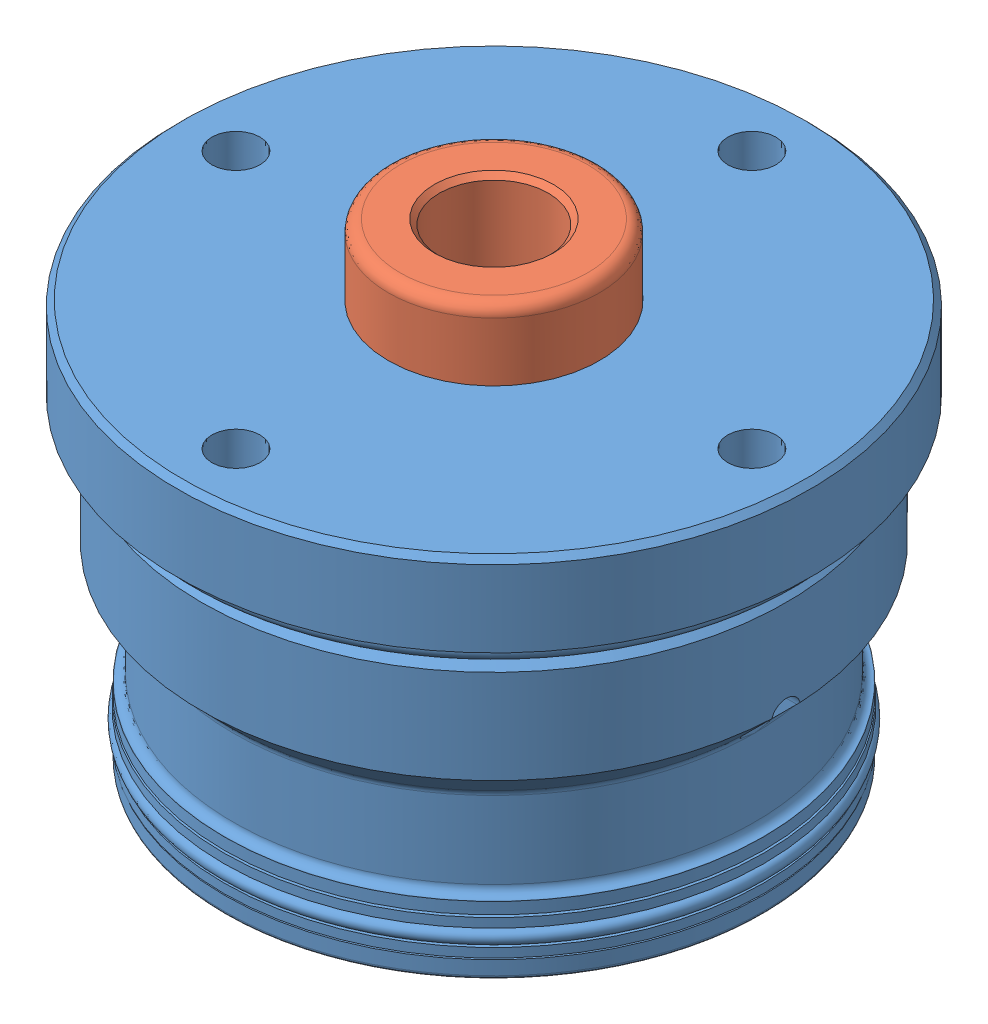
SolidWorks assembly ILC21022100.sldasm, configuration Default (file format 3400). Lengths in mm.
Overall size (85.72 63.49 85.72).
2 component instances, 2 part files, 3 mates.
Components (placement in the parent):
- ILC21022100_BODY-1: ILC21022100_BODY.sldprt [Default] at origin size (85.72 53.98 85.72)
- ILC21022100_PLUNGER-1: ILC21022100_PLUNGER.sldprt [Default] at (0 4.7625 0) x (0 1 0) z (0 0 1) size (58.72 60.32 60.32)
Mates (geometry in assembly coordinates):
- MID STROKE: distance = 4.7625 mm aligned: plane of ILC21022100_BODY-1 through (-36.4744 0 0) normal (0 -1 0); plane of ILC21022100_PLUNGER-1 through (-9.906 4.7625 0) normal (0 -1 0)
- Concentric1: concentric aligned: cylinder of ILC21022100_BODY-1; cylinder of ILC21022100_PLUNGER-1
- Coincident2: coincident aligned: unknown of ILC21022100_PLUNGER-1
